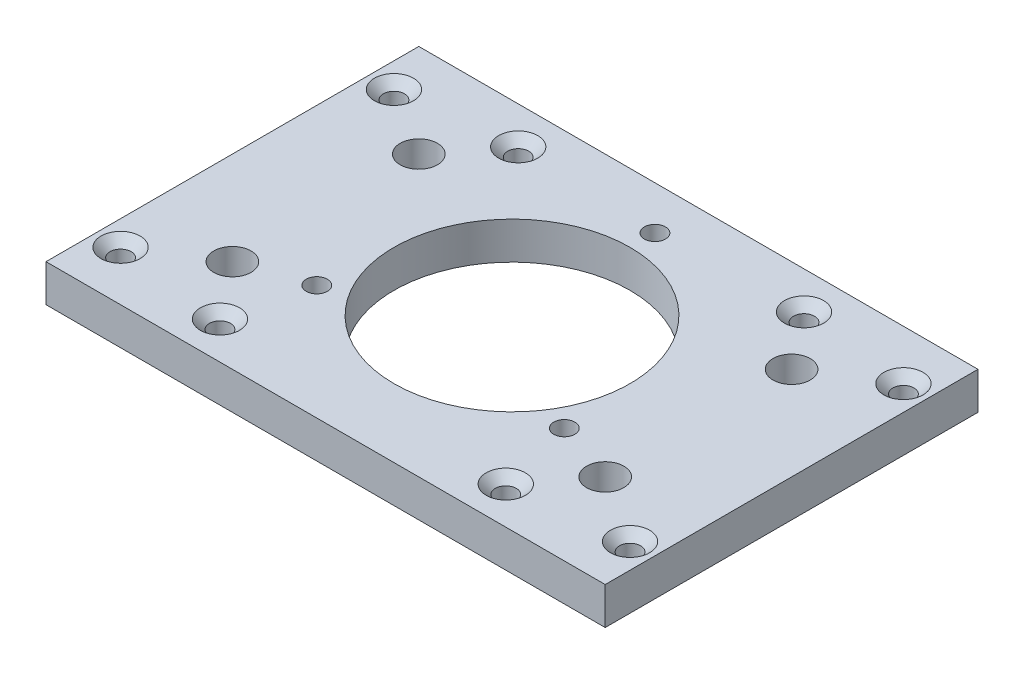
from build123d import *

# Parameters (mm, degrees)
SKETCH1_W                                       = 60
SKETCH1_H                                       = 6
BOSS_EXTRUDE1_DEPTH                             = 45
SKETCH2_R                                       = 19
CUT_EXTRUDE1_DEPTH                              = 55.415071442
CSK_FOR_M3_FLAT_HEAD_MACHINE_SCREW1_D           = 3.4
CSK_FOR_M3_FLAT_HEAD_MACHINE_SCREW1_CSINK_D     = 6.3
CSK_FOR_M3_FLAT_HEAD_MACHINE_SCREW1_CSINK_ANGLE = 90
CSK_FOR_M3_FLAT_HEAD_MACHINE_SCREW2_D           = 3.4
CSK_FOR_M3_FLAT_HEAD_MACHINE_SCREW2_CSINK_D     = 6.3
CSK_FOR_M3_FLAT_HEAD_MACHINE_SCREW2_CSINK_ANGLE = 90
CSK_FOR_M3_FLAT_HEAD_MACHINE_SCREW3_D           = 3.4
CSK_FOR_M3_FLAT_HEAD_MACHINE_SCREW3_CSINK_D     = 6.3
CSK_FOR_M3_FLAT_HEAD_MACHINE_SCREW3_CSINK_ANGLE = 90
F_6_0_6_DIAMETER_HOLE1_D                        = 6


with BuildPart() as part:
    # Sketch1 → Boss-Extrude1 (new, symmetric)
    with BuildSketch(Plane(origin=(0, 0, 0), x_dir=(0, 0, -1), z_dir=(1, 0, 0))):
        Rectangle(SKETCH1_W, SKETCH1_H)
    extrude(amount=BOSS_EXTRUDE1_DEPTH, both=True)

    # Sketch2 → Cut-Extrude1 (cut, through all)
    with BuildSketch(Plane(origin=(0, 3, 0), x_dir=(1, 0, 0), z_dir=(0, 1, 0))):
        with Locations(Location((0, 0, 0), (0, 0, 270))):
            Circle(SKETCH2_R)
    extrude(amount=-CUT_EXTRUDE1_DEPTH, mode=Mode.SUBTRACT)

    # CSK for M3 Flat Head Machine Screw1 (through all)
    with Locations(Plane(origin=(0, 3, 0), x_dir=(1, 0, 0), z_dir=(0, 1, 0))):
        with Locations((-23, 24), (23, 24), (23, -24), (-23, -24)):
            CounterSinkHole(CSK_FOR_M3_FLAT_HEAD_MACHINE_SCREW1_D / 2, CSK_FOR_M3_FLAT_HEAD_MACHINE_SCREW1_CSINK_D / 2, counter_sink_angle=CSK_FOR_M3_FLAT_HEAD_MACHINE_SCREW1_CSINK_ANGLE)

    # CSK for M3 Flat Head Machine Screw2 (through all)
    with Locations(Plane(origin=(0, 3, 0), x_dir=(1, 0, 0), z_dir=(0, 1, 0))):
        with Locations((-41, 22), (41, 22), (41, -22), (-41, -22)):
            CounterSinkHole(CSK_FOR_M3_FLAT_HEAD_MACHINE_SCREW2_D / 2, CSK_FOR_M3_FLAT_HEAD_MACHINE_SCREW2_CSINK_D / 2, counter_sink_angle=CSK_FOR_M3_FLAT_HEAD_MACHINE_SCREW2_CSINK_ANGLE)

    # CSK for M3 Flat Head Machine Screw3 (through all)
    with Locations(Plane(origin=(0, -3, 0), x_dir=(-1, 0, 0), z_dir=(0, -1, 0))):
        with Locations((19.918584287, -11.5), (-19.918584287, -11.5), (0, 23)):
            CounterSinkHole(CSK_FOR_M3_FLAT_HEAD_MACHINE_SCREW3_D / 2, CSK_FOR_M3_FLAT_HEAD_MACHINE_SCREW3_CSINK_D / 2, counter_sink_angle=CSK_FOR_M3_FLAT_HEAD_MACHINE_SCREW3_CSINK_ANGLE)

    # 6.0 _6_ Diameter Hole1 (through all)
    with Locations(Plane(origin=(0, 3, 0), x_dir=(1, 0, 0), z_dir=(0, 1, 0))):
        with Locations((-30, 15), (-30, -15), (30, -15), (30, 15)):
            Hole(F_6_0_6_DIAMETER_HOLE1_D / 2)


solid = part.part
